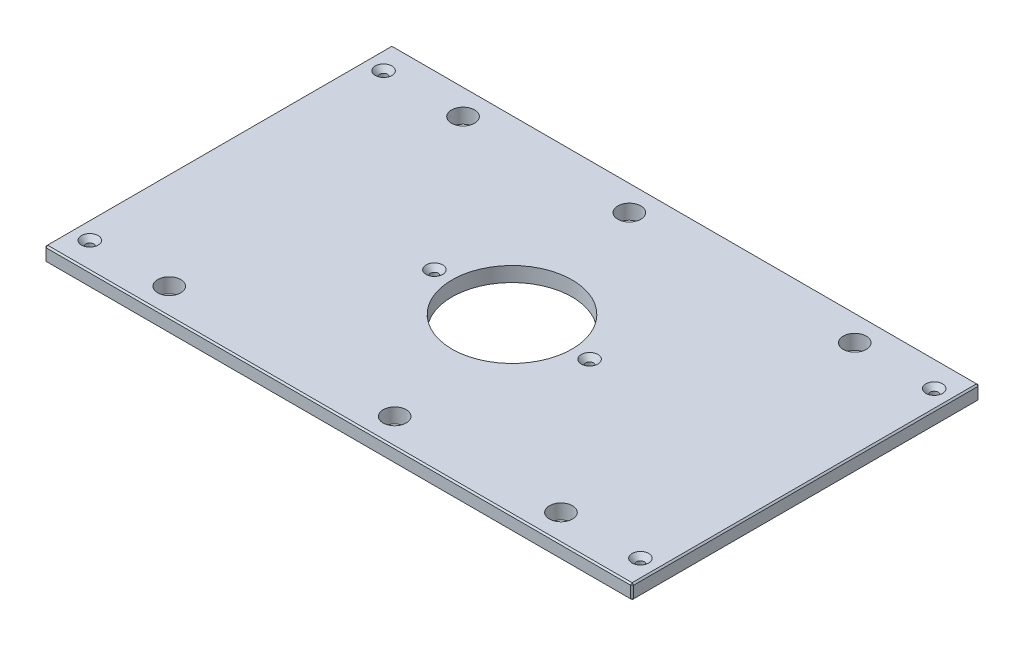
from build123d import *

# Parameters (mm, degrees)
SKETCH1_W                                        = 504.825
SKETCH1_H                                        = 298.45
BOSS_EXTRUDE1_DEPTH                              = 12.7
SKETCH13_R                                       = 51.562
CUT_EXTRUDE6_DEPTH                               = 294.498655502
F_25_32_0_78125_DIAMETER_HOLE1_D                 = 19.84375
CHAMFER2_SIZE                                    = 1.27
CSK_FOR_1_4_FLAT_HEAD_MACHINE_SCREW1_D           = 6.7564
CSK_FOR_1_4_FLAT_HEAD_MACHINE_SCREW1_CSINK_D     = 14.2748
CSK_FOR_1_4_FLAT_HEAD_MACHINE_SCREW1_CSINK_ANGLE = 82


with BuildPart() as part:
    # Sketch1 → Boss-Extrude1 (new body)
    with BuildSketch(Plane(origin=(0, 0, 0), x_dir=(1, 0, 0), z_dir=(0, 1, 0))):
        Rectangle(SKETCH1_W, SKETCH1_H)
    extrude(amount=BOSS_EXTRUDE1_DEPTH)

    # Sketch13 → Cut-Extrude6 (cut, through all)
    with BuildSketch(Plane(origin=(0, 12.7, 0), x_dir=(1, 0, 0), z_dir=(0, 1, 0))):
        with Locations(Location((0, 0, 0), (0, 0, 270))):
            Circle(SKETCH13_R)
    extrude(amount=-CUT_EXTRUDE6_DEPTH, mode=Mode.SUBTRACT)

    # 25_32 _0.78125_ Diameter Hole1 (through all)
    with Locations(Plane(origin=(0, 12.7, 0), x_dir=(1, 0, 0), z_dir=(0, 1, 0))):
        with Locations((168.275, 126.20498), (-168.275, 126.20498), (168.275, -126.20498), (-168.275, -126.20498), (-25.4, 126.20498), (25.4, -126.20498)):
            Hole(F_25_32_0_78125_DIAMETER_HOLE1_D / 2)

    # Chamfer2
    chamfer2_edges = [part.edges().sort_by_distance(p)[0] for p in [
        (252.4125, 12.7, 0),
        (0, 12.7, -149.225),
        (-252.4125, 12.7, 0),
        (0, 0, -149.225),
        (252.4125, 0, 0),
        (0, 0, 149.225),
        (-252.4125, 0, 0),
        (0, 12.7, 149.225),
        (-252.4125, 6.35, -149.225),
        (252.4125, 6.35, -149.225),
        (252.4125, 6.35, 149.225),
        (-252.4125, 6.35, 149.225),
    ]]
    chamfer(chamfer2_edges, length=CHAMFER2_SIZE)

    # CSK for 1_4 Flat Head Machine Screw1 (through all)
    with Locations(Plane(origin=(0, 12.7, 0), x_dir=(1, 0, 0), z_dir=(0, 1, 0))):
        with Locations((236.5375, 126.20498), (236.5375, -126.20498), (-236.5375, -126.20498), (-66.675, 0), (66.675, 0), (-236.5375, 126.20498), (-168.275, 126.20498), (-168.275, -126.20498)):
            CounterSinkHole(CSK_FOR_1_4_FLAT_HEAD_MACHINE_SCREW1_D / 2, CSK_FOR_1_4_FLAT_HEAD_MACHINE_SCREW1_CSINK_D / 2, counter_sink_angle=CSK_FOR_1_4_FLAT_HEAD_MACHINE_SCREW1_CSINK_ANGLE)


solid = part.part
